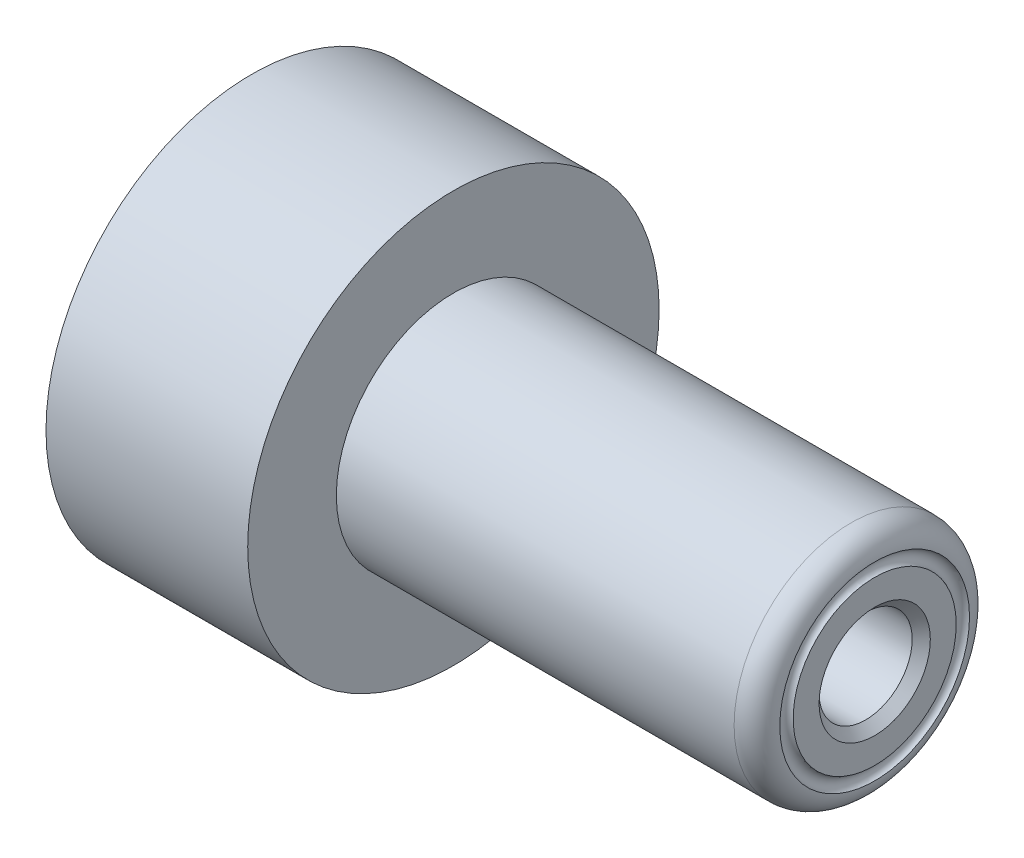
from build123d import *

# Parameters (mm, degrees)
SKETCH2_R          = 1.2065
CUT_EXTRUDE1_DEPTH = 2.54
SKETCH3_R          = 2.515
CUT_EXTRUDE2_DEPTH = 38.143429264
CHAMFER1_SIZE      = 0.49
SKETCH4_R          = 0.381


with BuildPart() as part:
    # Sketch1 → Revolve1 (revolve)
    with BuildSketch(Plane.XY, mode=Mode.PRIVATE) as revolve1_sk:
        with BuildLine():
            Line((0, 3.9751), (0, 11.1125))
            Line((0, 11.1125), (10.8966, 11.1125))
            Line((10.8966, 11.1125), (10.8966, 6.3246))
            Line((10.8966, 6.3246), (32.385, 6.3246))
            ThreePointArc((32.385, 6.3246), (33.283025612, 5.952625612), (33.655, 5.0546))
            Line((33.655, 5.0546), (33.655, 0))
            Line((33.655, 0), (21.8948, 0))
            Line((21.8948, 0), (21.8948, 3.9751))
            Line((21.8948, 3.9751), (0, 3.9751))
        make_face()
    revolve(revolve1_sk.sketch.rotate(Axis((0, 0, 0), (1, 0, 0)), 90), axis=Axis((0, 0, 0), (1, 0, 0)))

    # Sketch2 → Cut-Extrude1 (cut)
    with BuildSketch(Plane.ZY):
        with Locations((-6.7437, 0)):
            Circle(SKETCH2_R)
        with Locations(Location((6.7437, 0, 0), (0, 0, 180))):
            Circle(SKETCH2_R)
    extrude(amount=-CUT_EXTRUDE1_DEPTH, mode=Mode.SUBTRACT)

    # Sketch3 → Cut-Extrude2 (cut, through all)
    with BuildSketch(Plane(origin=(33.655, 0, 0), x_dir=(0, 0, -1), z_dir=(1, 0, 0))):
        Circle(SKETCH3_R)
    extrude(amount=-CUT_EXTRUDE2_DEPTH, mode=Mode.SUBTRACT)

    # Chamfer1
    chamfer1_edges = [part.edges().sort_by_distance(p)[0] for p in [
        (33.655, 0, 2.515),
    ]]
    chamfer(chamfer1_edges, length=CHAMFER1_SIZE)

    # Sketch4 → Cut-Revolve1 (revolve, cut)
    with BuildSketch(Plane.XY, mode=Mode.PRIVATE) as cut_revolve1_sk:
        with Locations((33.778, 4.765)):
            Circle(SKETCH4_R)
    revolve(cut_revolve1_sk.sketch.rotate(Axis((0, 0, 0), (1, 0, 0)), 90), axis=Axis((0, 0, 0), (1, 0, 0)), mode=Mode.SUBTRACT)


solid = part.part
